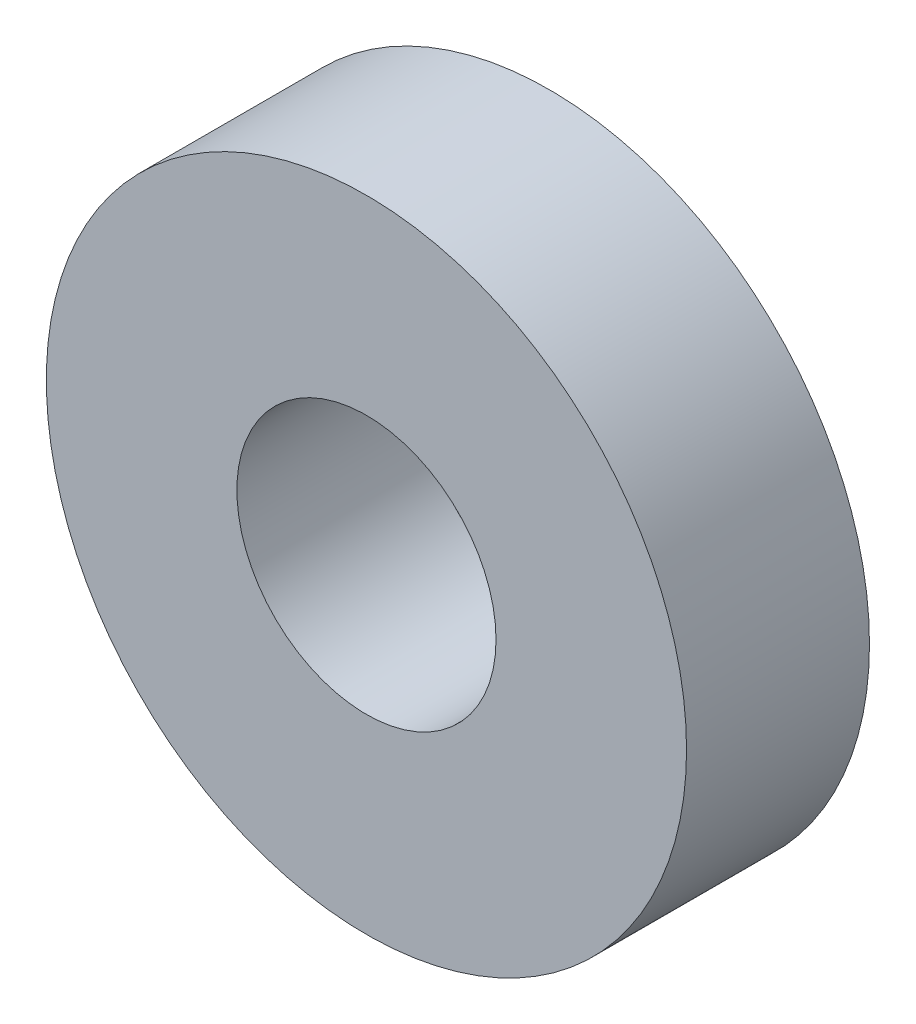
from build123d import *

# Parameters (mm, degrees)
SKETCH1_R           = 21
SKETCH1_R_2         = 8.5
BOSS_EXTRUDE1_DEPTH = 12


with BuildPart() as part:
    # Sketch1 → Boss-Extrude1 (new body)
    with BuildSketch(Plane.XY):
        Circle(SKETCH1_R)
        Circle(SKETCH1_R_2, mode=Mode.SUBTRACT)
    extrude(amount=BOSS_EXTRUDE1_DEPTH)


solid = part.part
